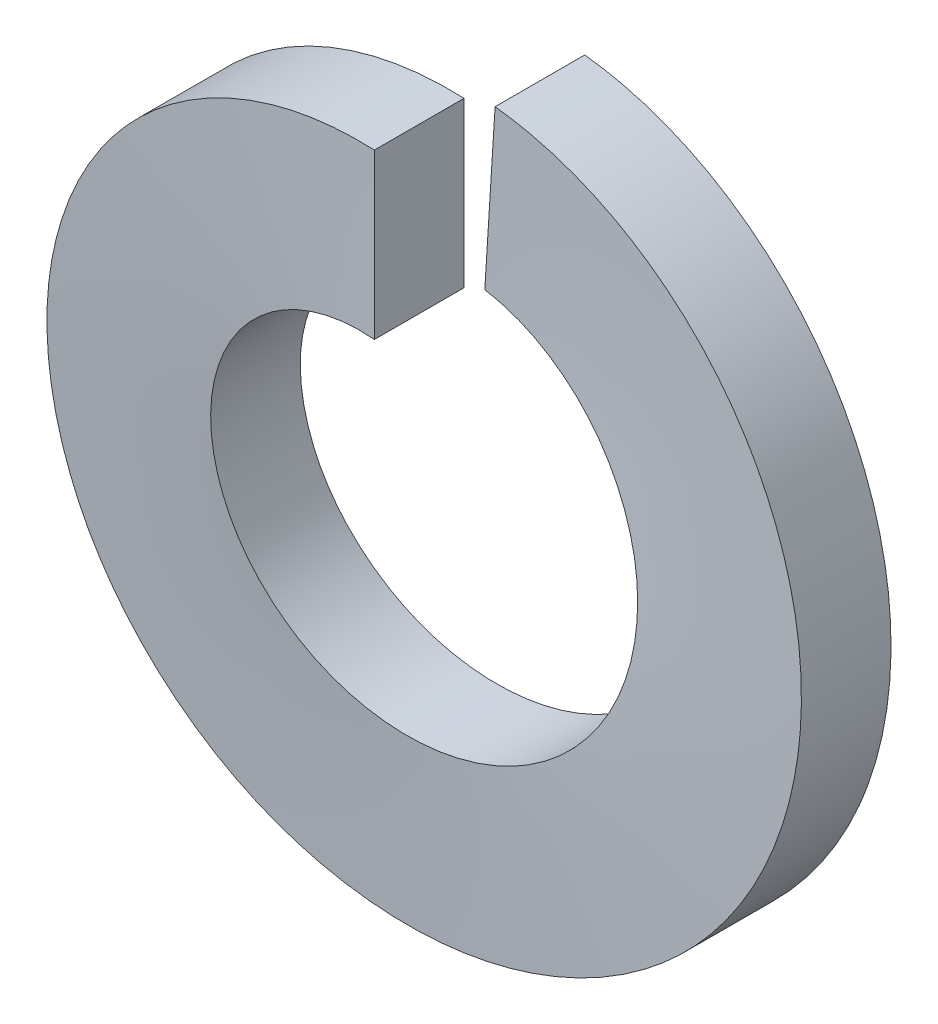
from build123d import *

# Parameters (mm, degrees)
SWEEP1_PITCH       = 1.749777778
SWEEP1_HEIGHT      = 1.73228
SWEEP1_RADIUS      = 6.1849
SWEEP1_START_ANGLE = 90
SKETCH2_W          = 1.5748
SKETCH2_H          = 2.8829


with BuildPart() as part:
    # Sweep1: sweep along a helix
    with BuildLine() as sweep1_path:
        add(Helix(SWEEP1_PITCH, SWEEP1_HEIGHT, SWEEP1_RADIUS, center=(0, 0, 0), direction=(0, 0, -1), lefthand=True, mode=Mode.PRIVATE).rotate(Axis((0, 0, 0), (0, 0, -1)), SWEEP1_START_ANGLE))
    # Sketch2 → Sweep1 (sweep)
    with BuildSketch(Plane(origin=(0, 0, 0), x_dir=(0, 0, -1), z_dir=(1, 0, 0))):
        with Locations((-0.7874, 4.74345)):
            Rectangle(SKETCH2_W, SKETCH2_H)
    sweep(path=sweep1_path.line, is_frenet=True)


solid = part.part
